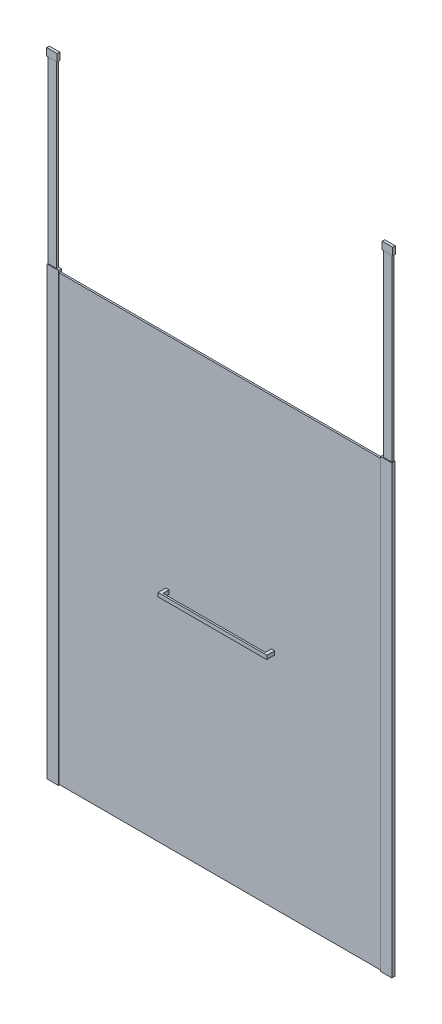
from build123d import *

# Parameters (mm, degrees)
DODANIE_WYCI_GNI_CIE1_START         = 3
DODANIE_WYCI_GNI_CIE1_DEPTH         = 2100
SZKIC2_W                            = 1547
SZKIC2_H                            = 8
DODANIE_WYCI_GNI_CIE2_DEPTH         = 2100
DODANIE_WYCI_GNI_CIE3_DEPTH         = 2108
SZKIC4_W                            = 53
SZKIC4_H                            = 14
DODANIE_WYCI_GNI_CIE4_DEPTH         = 11
SZKIC5_W                            = 53
SZKIC5_H                            = 14
DODANIE_WYCI_GNI_CIE5_DEPTH         = 3
SZKIC6_W                            = 8.1
SZKIC6_H                            = 7.8
DODANIE_WYCI_GNI_CIE6_DEPTH         = 15
SZKIC7_W                            = 53
SZKIC7_H                            = 14
DODANIE_WYCI_GNI_CIE7_DEPTH         = 3
SZKIC8_W                            = 53
SZKIC8_H                            = 14
DODANIE_WYCI_GNI_CIE8_DEPTH         = 3
SZKIC9_W                            = 40
SZKIC9_H                            = 8
DODANIE_WYCI_GNI_CIE9_DEPTH         = 883
DODANIE_WYCI_GNI_CIE9_2_DEPTH       = 883
DODANIE_WYCI_GNI_CIE10_START        = -32
SZKIC10_W                           = 50
SZKIC10_H                           = 12.5
DODANIE_WYCI_GNI_CIE10_DEPTH        = 35
DODANIE_WYCI_GNI_CIE11_DEPTH        = 36.5
DODANIE_WYCI_GNI_CIE11_DEPTH_BACK   = 18
SZKIC12_W                           = 15
SZKIC12_H                           = 18
DODANIE_WYCI_GNI_CIE11_2_DEPTH      = 36.5
DODANIE_WYCI_GNI_CIE11_2_DEPTH_BACK = 18
SZKIC13_W                           = 8
SZKIC13_H                           = 18
DODANIE_WYCI_GNI_CIE12_DEPTH        = 485


with BuildPart() as part:
    # Szkic1 → Dodanie-wyci_gni_cie1 (new body)
    with BuildSketch(Plane(origin=(0, 0, 0), x_dir=(1, 0, 0), z_dir=(0, 1, 0)).offset(DODANIE_WYCI_GNI_CIE1_START)):
        Polygon((0, 0), (0, 14), (53, 14), (53, 11), (42.9, 11), (42.9, 3), (53, 3), (53, 0), align=None)
    extrude(amount=DODANIE_WYCI_GNI_CIE1_DEPTH)

    # Szkic4 → Dodanie-wyci_gni_cie4 (add)
    with BuildSketch(Plane(origin=(0, 2103, 0), x_dir=(1, 0, 0), z_dir=(0, 1, 0))):
        with Locations((26.5, 7)):
            Rectangle(SZKIC4_W, SZKIC4_H)
    extrude(amount=DODANIE_WYCI_GNI_CIE4_DEPTH)

    # Szkic8 → Dodanie-wyci_gni_cie8 (add)
    with BuildSketch(Plane.XZ.offset(-3)):
        with Locations((26.5, -7)):
            Rectangle(SZKIC8_W, SZKIC8_H)
    extrude(amount=DODANIE_WYCI_GNI_CIE8_DEPTH)


with BuildPart() as body_2:
    # Szkic2 → Dodanie-wyci_gni_cie2 (new body)
    with BuildSketch(Plane.XZ.offset(-3)):
        with Locations((816.4, -7)):
            Rectangle(SZKIC2_W, SZKIC2_H)
    extrude(amount=-DODANIE_WYCI_GNI_CIE2_DEPTH)


with BuildPart() as body_3:
    # Szkic3 → Dodanie-wyci_gni_cie3 (new body)
    with BuildSketch(Plane.XZ.offset(-3)):
        Polygon((1579.8, -3), (1579.8, 0), (1632.8, 0), (1632.8, -14), (1579.8, -14), (1579.8, -11), (1589.9, -11), (1589.9, -3), align=None)
    extrude(amount=-DODANIE_WYCI_GNI_CIE3_DEPTH)

    # Szkic5 → Dodanie-wyci_gni_cie5 (add)
    with BuildSketch(Plane(origin=(0, 2111, 0), x_dir=(1, 0, 0), z_dir=(0, 1, 0))):
        with Locations((1606.3, 7)):
            Rectangle(SZKIC5_W, SZKIC5_H)
    extrude(amount=DODANIE_WYCI_GNI_CIE5_DEPTH)

    # Szkic6 → Dodanie-wyci_gni_cie6 (add)
    with BuildSketch(Plane.ZY.offset(-1579.8)):
        with Locations((-7, 2107.1)):
            Rectangle(SZKIC6_W, SZKIC6_H)
    extrude(amount=-DODANIE_WYCI_GNI_CIE6_DEPTH)

    # Szkic7 → Dodanie-wyci_gni_cie7 (add)
    with BuildSketch(Plane.XZ.offset(-3)):
        with Locations((1606.3, -7)):
            Rectangle(SZKIC7_W, SZKIC7_H)
    extrude(amount=DODANIE_WYCI_GNI_CIE7_DEPTH)


with BuildPart() as body_4:
    # Szkic9 → Dodanie-wyci_gni_cie9 (new body)
    with BuildSketch(Plane(origin=(0, 2114, 2099.6), x_dir=(-1, 0, 0), z_dir=(0, -1, 0))):
        with Locations((-1611.3, 2106.6)):
            Rectangle(SZKIC9_W, SZKIC9_H)
    extrude(amount=-DODANIE_WYCI_GNI_CIE9_DEPTH)

    # Szkic10 → Dodanie-wyci_gni_cie10 (add)
    with BuildSketch(Plane(origin=(0, 2997, 0), x_dir=(-1, 0, 0), z_dir=(0, 1, 0)).offset(DODANIE_WYCI_GNI_CIE10_START)):
        with Locations((-1611.3, -7)):
            Rectangle(SZKIC10_W, SZKIC10_H)
        with Locations((-21.5, -7)):
            Rectangle(SZKIC10_W, SZKIC10_H)
    extrude(amount=DODANIE_WYCI_GNI_CIE10_DEPTH)


with BuildPart() as body_5:
    # Szkic9 → Dodanie-wyci_gni_cie9 2 (new body)
    with BuildSketch(Plane(origin=(0, 2114, 2099.6), x_dir=(-1, 0, 0), z_dir=(0, -1, 0))):
        with Locations((-21.5, 2106.6)):
            Rectangle(SZKIC9_W, SZKIC9_H)
    extrude(amount=-DODANIE_WYCI_GNI_CIE9_2_DEPTH)


with BuildPart() as dodanie_wyci_gni_cie10_piece_1:
    # of the separate pieces the step leaves, piece 1, a body of its own (dodanie_wyci_gni_cie10_pieces)
    add(body_4.part.solids().sort_by_distance((1631.3, 2114, -11))[0])


with BuildPart() as dodanie_wyci_gni_cie10_piece_2:
    # of the separate pieces the step leaves, piece 2, a body of its own (dodanie_wyci_gni_cie10_pieces)
    add(body_4.part.solids().sort_by_distance((-3.5, 2965, -13.25))[0])


with BuildPart() as body_7:
    # Szkic12 → Dodanie-wyci_gni_cie11 (new, two sides: drawn at the far end of the back side and taken through both)
    with BuildSketch(Plane.XY.offset(-3).offset(-DODANIE_WYCI_GNI_CIE11_DEPTH_BACK)):
        with Locations((566.4, 1053)):
            Rectangle(SZKIC12_W, SZKIC12_H)
    extrude(amount=DODANIE_WYCI_GNI_CIE11_DEPTH + DODANIE_WYCI_GNI_CIE11_DEPTH_BACK)



with BuildPart() as body_8:
    # Szkic12 → Dodanie-wyci_gni_cie11 2 (new, two sides: drawn at the far end of the back side and taken through both)
    with BuildSketch(Plane.XY.offset(-3).offset(-DODANIE_WYCI_GNI_CIE11_2_DEPTH_BACK)):
        with Locations((1066.4, 1053)):
            Rectangle(SZKIC12_W, SZKIC12_H)
    extrude(amount=DODANIE_WYCI_GNI_CIE11_2_DEPTH + DODANIE_WYCI_GNI_CIE11_2_DEPTH_BACK)


with BuildPart() as body_7_1:
    add(body_7.part)

    add(body_8.part)  # Dodanie-wyci_gni_cie12 merges body 8
    # Szkic13 → Dodanie-wyci_gni_cie12 (add)
    with BuildSketch(Plane(origin=(573.9, 0, 0), x_dir=(0, 0, -1), z_dir=(1, 0, 0))):
        with Locations((-29.5, 1053)):
            Rectangle(SZKIC13_W, SZKIC13_H)
    extrude(amount=DODANIE_WYCI_GNI_CIE12_DEPTH)


solid = Compound([part.part, body_2.part, body_3.part, body_5.part, dodanie_wyci_gni_cie10_piece_1.part, dodanie_wyci_gni_cie10_piece_2.part, body_7_1.part])
